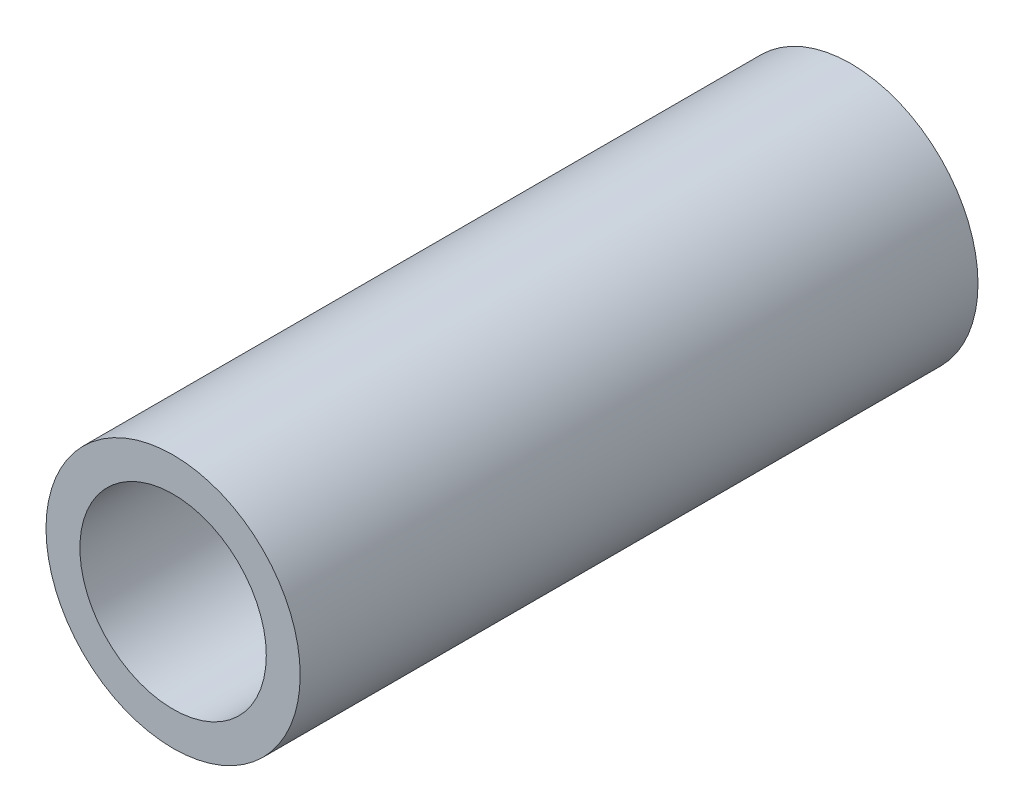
from build123d import *

# Parameters (mm, degrees)
SKETCH1_R           = 9.525
SKETCH1_R_2         = 6.985
BOSS_EXTRUDE1_DEPTH = 50.8


with BuildPart() as part:
    # Sketch1 → Boss-Extrude1 (new body)
    with BuildSketch(Plane.XY):
        with Locations((-120.65, 61698.307021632)):
            Circle(SKETCH1_R)
        with Locations((-120.65, 61698.307021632)):
            Circle(SKETCH1_R_2, mode=Mode.SUBTRACT)
    extrude(amount=BOSS_EXTRUDE1_DEPTH)


solid = part.part
